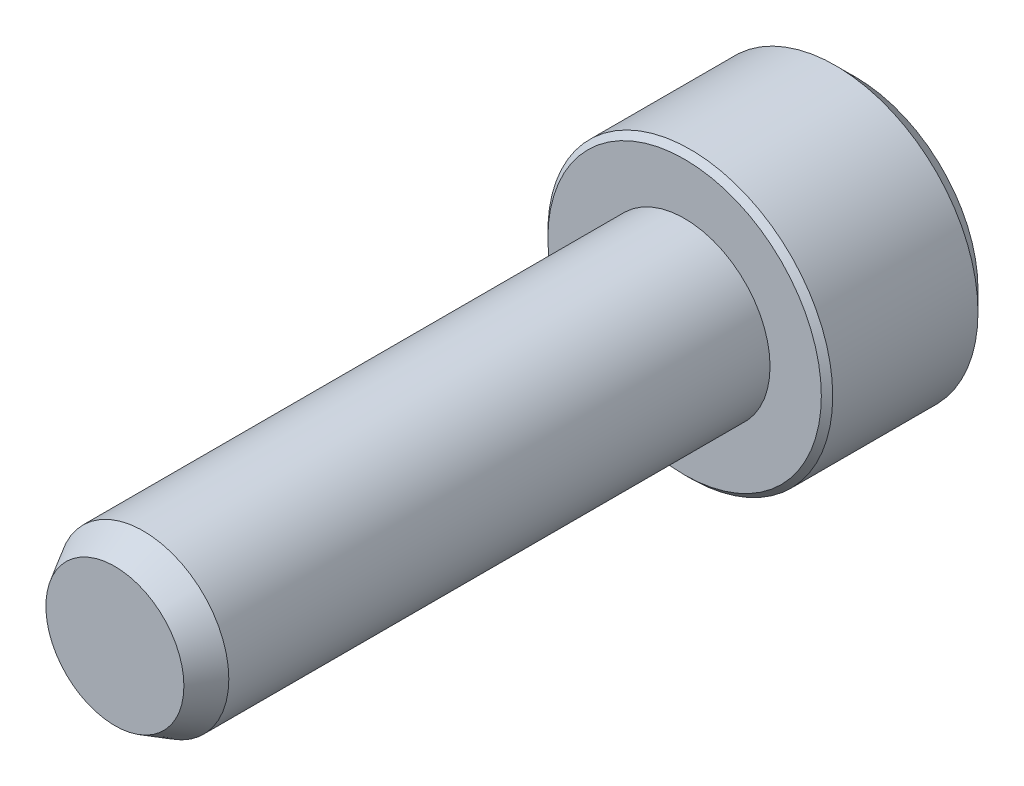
ISO-10303-21;
HEADER;
FILE_DESCRIPTION(('STEP AP214'),'2;1');
FILE_NAME('part.step','',(''),(''),'','','');
FILE_SCHEMA(('AUTOMOTIVE_DESIGN { 1 0 10303 214 1 1 1 1 }'));
ENDSEC;
DATA;
#1=APPLICATION_CONTEXT('core data for automotive mechanical design processes');
#2=APPLICATION_PROTOCOL_DEFINITION('international standard','automotive_design',2000,#1);
#3=PRODUCT_CONTEXT('',#1,'mechanical');
#4=PRODUCT('Part','Part','',(#3));
#5=PRODUCT_RELATED_PRODUCT_CATEGORY('part','',(#4));
#6=PRODUCT_DEFINITION_FORMATION('','',#4);
#7=PRODUCT_DEFINITION_CONTEXT('part definition',#1,'design');
#8=PRODUCT_DEFINITION('design','',#6,#7);
#9=PRODUCT_DEFINITION_SHAPE('','',#8);
#10=(LENGTH_UNIT() NAMED_UNIT(*) SI_UNIT(.MILLI.,.METRE.));
#11=(NAMED_UNIT(*) PLANE_ANGLE_UNIT() SI_UNIT($,.RADIAN.));
#12=(NAMED_UNIT(*) SI_UNIT($,.STERADIAN.) SOLID_ANGLE_UNIT());
#13=UNCERTAINTY_MEASURE_WITH_UNIT(LENGTH_MEASURE(1.E-05),#10,'distance_accuracy_value','');
#14=(GEOMETRIC_REPRESENTATION_CONTEXT(3) GLOBAL_UNCERTAINTY_ASSIGNED_CONTEXT((#13)) GLOBAL_UNIT_ASSIGNED_CONTEXT((#10,
#11,#12)) REPRESENTATION_CONTEXT('',''));
#15=CARTESIAN_POINT('',(0.,0.,0.));
#16=DIRECTION('',(0.,0.,1.));
#17=DIRECTION('',(1.,0.,0.));
#18=AXIS2_PLACEMENT_3D('',#15,#16,#17);
#19=CARTESIAN_POINT('',(0.,0.,-6.));
#20=DIRECTION('',(0.,0.,1.));
#21=DIRECTION('',(1.,0.,0.));
#22=AXIS2_PLACEMENT_3D('',#19,#20,#21);
#23=PLANE('',#22);
#24=CARTESIAN_POINT('',(0.,0.,-6.));
#25=DIRECTION('',(0.,0.,1.));
#26=DIRECTION('',(1.,0.,0.));
#27=AXIS2_PLACEMENT_3D('',#24,#25,#26);
#28=CIRCLE('',#27,4.3);
#29=CARTESIAN_POINT('',(4.3,0.,-6.));
#30=VERTEX_POINT('',#29);
#31=EDGE_CURVE('E140',#30,#30,#28,.F.);
#32=ORIENTED_EDGE('',*,*,#31,.T.);
#33=EDGE_LOOP('',(#32));
#34=FACE_BOUND('',#33,.T.);
#35=DIRECTION('',(-0.500000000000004,-0.866025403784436,0.));
#36=VECTOR('',#35,1.);
#37=CARTESIAN_POINT('',(-1.44337567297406,2.5,-6.));
#38=LINE('',#37,#36);
#39=CARTESIAN_POINT('',(-1.44337567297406,2.5,-6.));
#40=VERTEX_POINT('',#39);
#41=CARTESIAN_POINT('',(-2.88675134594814,0.,-6.));
#42=VERTEX_POINT('',#41);
#43=EDGE_CURVE('E47',#40,#42,#38,.T.);
#44=ORIENTED_EDGE('',*,*,#43,.T.);
#45=DIRECTION('',(0.500000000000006,-0.866025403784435,0.));
#46=VECTOR('',#45,1.);
#47=CARTESIAN_POINT('',(-2.88675134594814,0.,-6.));
#48=LINE('',#47,#46);
#49=CARTESIAN_POINT('',(-1.44337567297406,-2.5,-6.));
#50=VERTEX_POINT('',#49);
#51=EDGE_CURVE('E87',#42,#50,#48,.T.);
#52=ORIENTED_EDGE('',*,*,#51,.T.);
#53=DIRECTION('',(1.,0.,0.));
#54=VECTOR('',#53,1.);
#55=CARTESIAN_POINT('',(-1.44337567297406,-2.5,-6.));
#56=LINE('',#55,#54);
#57=CARTESIAN_POINT('',(1.44337567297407,-2.5,-6.));
#58=VERTEX_POINT('',#57);
#59=EDGE_CURVE('E95',#50,#58,#56,.T.);
#60=ORIENTED_EDGE('',*,*,#59,.T.);
#61=DIRECTION('',(0.500000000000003,0.866025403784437,0.));
#62=VECTOR('',#61,1.);
#63=CARTESIAN_POINT('',(1.44337567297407,-2.5,-6.));
#64=LINE('',#63,#62);
#65=CARTESIAN_POINT('',(2.88675134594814,0.,-6.));
#66=VERTEX_POINT('',#65);
#67=EDGE_CURVE('E110',#58,#66,#64,.T.);
#68=ORIENTED_EDGE('',*,*,#67,.T.);
#69=DIRECTION('',(-0.499999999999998,0.86602540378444,0.));
#70=VECTOR('',#69,1.);
#71=CARTESIAN_POINT('',(1.44337567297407,2.5,-6.));
#72=LINE('',#71,#70);
#73=CARTESIAN_POINT('',(1.44337567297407,2.5,-6.));
#74=VERTEX_POINT('',#73);
#75=EDGE_CURVE('E113',#66,#74,#72,.T.);
#76=ORIENTED_EDGE('',*,*,#75,.T.);
#77=DIRECTION('',(-1.,0.,0.));
#78=VECTOR('',#77,1.);
#79=CARTESIAN_POINT('',(-1.44337567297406,2.5,-6.));
#80=LINE('',#79,#78);
#81=EDGE_CURVE('E106',#74,#40,#80,.T.);
#82=ORIENTED_EDGE('',*,*,#81,.T.);
#83=EDGE_LOOP('',(#44,#52,#60,#68,#76,#82));
#84=FACE_BOUND('',#83,.T.);
#85=ADVANCED_FACE('F32',(#34,#84),#23,.F.);
#86=CARTESIAN_POINT('',(0.,0.,20.));
#87=DIRECTION('',(0.,0.,-1.));
#88=DIRECTION('',(-1.,0.,0.));
#89=AXIS2_PLACEMENT_3D('',#86,#87,#88);
#90=CYLINDRICAL_SURFACE('',#89,3.);
#91=CARTESIAN_POINT('',(0.,0.,19.));
#92=DIRECTION('',(0.,0.,1.));
#93=DIRECTION('',(1.,0.,0.));
#94=AXIS2_PLACEMENT_3D('',#91,#92,#93);
#95=CIRCLE('',#94,3.);
#96=CARTESIAN_POINT('',(3.,0.,19.));
#97=VERTEX_POINT('',#96);
#98=EDGE_CURVE('E146',#97,#97,#95,.F.);
#99=ORIENTED_EDGE('',*,*,#98,.T.);
#100=EDGE_LOOP('',(#99));
#101=FACE_BOUND('',#100,.T.);
#102=CARTESIAN_POINT('',(0.,0.,0.));
#103=DIRECTION('',(0.,0.,1.));
#104=DIRECTION('',(1.,0.,0.));
#105=AXIS2_PLACEMENT_3D('',#102,#103,#104);
#106=CIRCLE('',#105,3.);
#107=CARTESIAN_POINT('',(3.,0.,0.));
#108=VERTEX_POINT('',#107);
#109=EDGE_CURVE('E101',#108,#108,#106,.T.);
#110=ORIENTED_EDGE('',*,*,#109,.T.);
#111=EDGE_LOOP('',(#110));
#112=FACE_BOUND('',#111,.T.);
#113=ADVANCED_FACE('F34',(#101,#112),#90,.T.);
#114=CARTESIAN_POINT('',(0.,0.,20.));
#115=DIRECTION('',(0.,0.,1.));
#116=DIRECTION('',(1.,0.,0.));
#117=AXIS2_PLACEMENT_3D('',#114,#115,#116);
#118=PLANE('',#117);
#119=CARTESIAN_POINT('',(0.,0.,20.));
#120=DIRECTION('',(0.,0.,1.));
#121=DIRECTION('',(1.,0.,0.));
#122=AXIS2_PLACEMENT_3D('',#119,#120,#121);
#123=CIRCLE('',#122,2.42264973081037);
#124=CARTESIAN_POINT('',(2.42264973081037,0.,20.));
#125=VERTEX_POINT('',#124);
#126=EDGE_CURVE('E143',#125,#125,#123,.T.);
#127=ORIENTED_EDGE('',*,*,#126,.T.);
#128=EDGE_LOOP('',(#127));
#129=FACE_BOUND('',#128,.T.);
#130=ADVANCED_FACE('F172',(#129),#118,.T.);
#131=CARTESIAN_POINT('',(0.,0.,0.));
#132=DIRECTION('',(0.,0.,1.));
#133=DIRECTION('',(1.,0.,0.));
#134=AXIS2_PLACEMENT_3D('',#131,#132,#133);
#135=PLANE('',#134);
#136=CARTESIAN_POINT('',(0.,0.,0.));
#137=DIRECTION('',(0.,0.,1.));
#138=DIRECTION('',(1.,0.,0.));
#139=AXIS2_PLACEMENT_3D('',#136,#137,#138);
#140=CIRCLE('',#139,4.8);
#141=CARTESIAN_POINT('',(4.8,0.,0.));
#142=VERTEX_POINT('',#141);
#143=EDGE_CURVE('E40',#142,#142,#140,.T.);
#144=ORIENTED_EDGE('',*,*,#143,.T.);
#145=EDGE_LOOP('',(#144));
#146=FACE_BOUND('',#145,.T.);
#147=ORIENTED_EDGE('',*,*,#109,.F.);
#148=EDGE_LOOP('',(#147));
#149=FACE_BOUND('',#148,.T.);
#150=ADVANCED_FACE('F151',(#146,#149),#135,.T.);
#151=CARTESIAN_POINT('',(0.,0.,-6.));
#152=DIRECTION('',(0.,0.,1.));
#153=DIRECTION('',(1.,0.,0.));
#154=AXIS2_PLACEMENT_3D('',#151,#152,#153);
#155=CYLINDRICAL_SURFACE('',#154,5.);
#156=CARTESIAN_POINT('',(0.,0.,-0.200000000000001));
#157=DIRECTION('',(0.,0.,1.));
#158=DIRECTION('',(1.,0.,0.));
#159=AXIS2_PLACEMENT_3D('',#156,#157,#158);
#160=CIRCLE('',#159,5.);
#161=CARTESIAN_POINT('',(5.,0.,-0.200000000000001));
#162=VERTEX_POINT('',#161);
#163=EDGE_CURVE('E11',#162,#162,#160,.F.);
#164=ORIENTED_EDGE('',*,*,#163,.T.);
#165=EDGE_LOOP('',(#164));
#166=FACE_BOUND('',#165,.T.);
#167=CARTESIAN_POINT('',(0.,0.,-5.3));
#168=DIRECTION('',(0.,0.,1.));
#169=DIRECTION('',(1.,0.,0.));
#170=AXIS2_PLACEMENT_3D('',#167,#168,#169);
#171=CIRCLE('',#170,5.);
#172=CARTESIAN_POINT('',(5.,0.,-5.3));
#173=VERTEX_POINT('',#172);
#174=EDGE_CURVE('E137',#173,#173,#171,.T.);
#175=ORIENTED_EDGE('',*,*,#174,.T.);
#176=EDGE_LOOP('',(#175));
#177=FACE_BOUND('',#176,.T.);
#178=ADVANCED_FACE('F177',(#166,#177),#155,.T.);
#179=CARTESIAN_POINT('',(-1.44337567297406,2.5,-3.));
#180=DIRECTION('',(0.866025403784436,-0.500000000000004,0.));
#181=DIRECTION('',(0.500000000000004,0.866025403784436,0.));
#182=AXIS2_PLACEMENT_3D('',#179,#180,#181);
#183=PLANE('',#182);
#184=ORIENTED_EDGE('',*,*,#43,.F.);
#185=DIRECTION('',(0.,0.,-1.));
#186=VECTOR('',#185,1.);
#187=CARTESIAN_POINT('',(-1.44337567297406,2.5,-3.));
#188=LINE('',#187,#186);
#189=CARTESIAN_POINT('',(-1.44337567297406,2.5,-3.));
#190=VERTEX_POINT('',#189);
#191=EDGE_CURVE('E126',#190,#40,#188,.T.);
#192=ORIENTED_EDGE('',*,*,#191,.F.);
#193=DIRECTION('',(-0.500000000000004,-0.866025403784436,0.));
#194=VECTOR('',#193,1.);
#195=CARTESIAN_POINT('',(-1.44337567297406,2.5,-3.));
#196=LINE('',#195,#194);
#197=CARTESIAN_POINT('',(-2.88675134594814,0.,-3.));
#198=VERTEX_POINT('',#197);
#199=EDGE_CURVE('E100',#190,#198,#196,.T.);
#200=ORIENTED_EDGE('',*,*,#199,.T.);
#201=DIRECTION('',(0.,0.,-1.));
#202=VECTOR('',#201,1.);
#203=CARTESIAN_POINT('',(-2.88675134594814,0.,-3.));
#204=LINE('',#203,#202);
#205=EDGE_CURVE('E89',#198,#42,#204,.T.);
#206=ORIENTED_EDGE('',*,*,#205,.T.);
#207=EDGE_LOOP('',(#184,#192,#200,#206));
#208=FACE_BOUND('',#207,.T.);
#209=ADVANCED_FACE('F98',(#208),#183,.T.);
#210=CARTESIAN_POINT('',(-2.88675134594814,0.,-3.));
#211=DIRECTION('',(0.866025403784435,0.500000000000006,0.));
#212=DIRECTION('',(-0.500000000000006,0.866025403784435,0.));
#213=AXIS2_PLACEMENT_3D('',#210,#211,#212);
#214=PLANE('',#213);
#215=ORIENTED_EDGE('',*,*,#51,.F.);
#216=ORIENTED_EDGE('',*,*,#205,.F.);
#217=DIRECTION('',(0.500000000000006,-0.866025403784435,0.));
#218=VECTOR('',#217,1.);
#219=CARTESIAN_POINT('',(-2.88675134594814,0.,-3.));
#220=LINE('',#219,#218);
#221=CARTESIAN_POINT('',(-1.44337567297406,-2.5,-3.));
#222=VERTEX_POINT('',#221);
#223=EDGE_CURVE('E117',#198,#222,#220,.T.);
#224=ORIENTED_EDGE('',*,*,#223,.T.);
#225=DIRECTION('',(0.,0.,-1.));
#226=VECTOR('',#225,1.);
#227=CARTESIAN_POINT('',(-1.44337567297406,-2.5,-3.));
#228=LINE('',#227,#226);
#229=EDGE_CURVE('E91',#222,#50,#228,.T.);
#230=ORIENTED_EDGE('',*,*,#229,.T.);
#231=EDGE_LOOP('',(#215,#216,#224,#230));
#232=FACE_BOUND('',#231,.T.);
#233=ADVANCED_FACE('F88',(#232),#214,.T.);
#234=CARTESIAN_POINT('',(-1.44337567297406,-2.5,-3.));
#235=DIRECTION('',(0.,1.,0.));
#236=DIRECTION('',(0.,0.,1.));
#237=AXIS2_PLACEMENT_3D('',#234,#235,#236);
#238=PLANE('',#237);
#239=ORIENTED_EDGE('',*,*,#59,.F.);
#240=ORIENTED_EDGE('',*,*,#229,.F.);
#241=DIRECTION('',(1.,0.,0.));
#242=VECTOR('',#241,1.);
#243=CARTESIAN_POINT('',(-1.44337567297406,-2.5,-3.));
#244=LINE('',#243,#242);
#245=CARTESIAN_POINT('',(1.44337567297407,-2.5,-3.));
#246=VERTEX_POINT('',#245);
#247=EDGE_CURVE('E119',#222,#246,#244,.T.);
#248=ORIENTED_EDGE('',*,*,#247,.T.);
#249=DIRECTION('',(0.,0.,-1.));
#250=VECTOR('',#249,1.);
#251=CARTESIAN_POINT('',(1.44337567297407,-2.5,-3.));
#252=LINE('',#251,#250);
#253=EDGE_CURVE('E132',#246,#58,#252,.T.);
#254=ORIENTED_EDGE('',*,*,#253,.T.);
#255=EDGE_LOOP('',(#239,#240,#248,#254));
#256=FACE_BOUND('',#255,.T.);
#257=ADVANCED_FACE('F205',(#256),#238,.T.);
#258=CARTESIAN_POINT('',(1.44337567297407,-2.5,-3.));
#259=DIRECTION('',(-0.866025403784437,0.500000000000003,0.));
#260=DIRECTION('',(-0.500000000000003,-0.866025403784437,0.));
#261=AXIS2_PLACEMENT_3D('',#258,#259,#260);
#262=PLANE('',#261);
#263=ORIENTED_EDGE('',*,*,#67,.F.);
#264=ORIENTED_EDGE('',*,*,#253,.F.);
#265=DIRECTION('',(0.500000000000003,0.866025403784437,0.));
#266=VECTOR('',#265,1.);
#267=CARTESIAN_POINT('',(1.44337567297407,-2.5,-3.));
#268=LINE('',#267,#266);
#269=CARTESIAN_POINT('',(2.88675134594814,0.,-3.));
#270=VERTEX_POINT('',#269);
#271=EDGE_CURVE('E121',#246,#270,#268,.T.);
#272=ORIENTED_EDGE('',*,*,#271,.T.);
#273=DIRECTION('',(0.,0.,-1.));
#274=VECTOR('',#273,1.);
#275=CARTESIAN_POINT('',(2.88675134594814,0.,-3.));
#276=LINE('',#275,#274);
#277=EDGE_CURVE('E130',#270,#66,#276,.T.);
#278=ORIENTED_EDGE('',*,*,#277,.T.);
#279=EDGE_LOOP('',(#263,#264,#272,#278));
#280=FACE_BOUND('',#279,.T.);
#281=ADVANCED_FACE('F212',(#280),#262,.T.);
#282=CARTESIAN_POINT('',(1.44337567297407,2.5,-3.));
#283=DIRECTION('',(-0.86602540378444,-0.499999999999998,0.));
#284=DIRECTION('',(0.499999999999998,-0.86602540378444,0.));
#285=AXIS2_PLACEMENT_3D('',#282,#283,#284);
#286=PLANE('',#285);
#287=ORIENTED_EDGE('',*,*,#75,.F.);
#288=ORIENTED_EDGE('',*,*,#277,.F.);
#289=DIRECTION('',(-0.499999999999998,0.86602540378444,0.));
#290=VECTOR('',#289,1.);
#291=CARTESIAN_POINT('',(1.44337567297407,2.5,-3.));
#292=LINE('',#291,#290);
#293=CARTESIAN_POINT('',(1.44337567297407,2.5,-3.));
#294=VERTEX_POINT('',#293);
#295=EDGE_CURVE('E123',#270,#294,#292,.T.);
#296=ORIENTED_EDGE('',*,*,#295,.T.);
#297=DIRECTION('',(0.,0.,-1.));
#298=VECTOR('',#297,1.);
#299=CARTESIAN_POINT('',(1.44337567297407,2.5,-3.));
#300=LINE('',#299,#298);
#301=EDGE_CURVE('E128',#294,#74,#300,.T.);
#302=ORIENTED_EDGE('',*,*,#301,.T.);
#303=EDGE_LOOP('',(#287,#288,#296,#302));
#304=FACE_BOUND('',#303,.T.);
#305=ADVANCED_FACE('F220',(#304),#286,.T.);
#306=CARTESIAN_POINT('',(-1.44337567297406,2.5,-3.));
#307=DIRECTION('',(0.,-1.,0.));
#308=DIRECTION('',(0.,0.,-1.));
#309=AXIS2_PLACEMENT_3D('',#306,#307,#308);
#310=PLANE('',#309);
#311=ORIENTED_EDGE('',*,*,#81,.F.);
#312=ORIENTED_EDGE('',*,*,#301,.F.);
#313=DIRECTION('',(-1.,0.,0.));
#314=VECTOR('',#313,1.);
#315=CARTESIAN_POINT('',(-1.44337567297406,2.5,-3.));
#316=LINE('',#315,#314);
#317=EDGE_CURVE('E54',#294,#190,#316,.T.);
#318=ORIENTED_EDGE('',*,*,#317,.T.);
#319=ORIENTED_EDGE('',*,*,#191,.T.);
#320=EDGE_LOOP('',(#311,#312,#318,#319));
#321=FACE_BOUND('',#320,.T.);
#322=ADVANCED_FACE('F228',(#321),#310,.T.);
#323=CARTESIAN_POINT('',(-2.88675134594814,0.,-3.));
#324=DIRECTION('',(0.,0.,1.));
#325=DIRECTION('',(1.,0.,0.));
#326=AXIS2_PLACEMENT_3D('',#323,#324,#325);
#327=PLANE('',#326);
#328=ORIENTED_EDGE('',*,*,#199,.F.);
#329=ORIENTED_EDGE('',*,*,#317,.F.);
#330=ORIENTED_EDGE('',*,*,#295,.F.);
#331=ORIENTED_EDGE('',*,*,#271,.F.);
#332=ORIENTED_EDGE('',*,*,#247,.F.);
#333=ORIENTED_EDGE('',*,*,#223,.F.);
#334=EDGE_LOOP('',(#328,#329,#330,#331,#332,#333));
#335=FACE_BOUND('',#334,.T.);
#336=ADVANCED_FACE('F236',(#335),#327,.F.);
#337=CARTESIAN_POINT('',(0.,0.,-5.3));
#338=DIRECTION('',(0.,0.,1.));
#339=DIRECTION('',(1.,0.,0.));
#340=AXIS2_PLACEMENT_3D('',#337,#338,#339);
#341=CONICAL_SURFACE('',#340,5.,0.78539816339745);
#342=ORIENTED_EDGE('',*,*,#31,.F.);
#343=EDGE_LOOP('',(#342));
#344=FACE_BOUND('',#343,.T.);
#345=ORIENTED_EDGE('',*,*,#174,.F.);
#346=EDGE_LOOP('',(#345));
#347=FACE_BOUND('',#346,.T.);
#348=ADVANCED_FACE('F162',(#344,#347),#341,.T.);
#349=CARTESIAN_POINT('',(0.,0.,20.));
#350=DIRECTION('',(0.,0.,-1.));
#351=DIRECTION('',(-1.,0.,0.));
#352=AXIS2_PLACEMENT_3D('',#349,#350,#351);
#353=CONICAL_SURFACE('',#352,2.42264973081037,0.523598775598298);
#354=ORIENTED_EDGE('',*,*,#98,.F.);
#355=EDGE_LOOP('',(#354));
#356=FACE_BOUND('',#355,.T.);
#357=ORIENTED_EDGE('',*,*,#126,.F.);
#358=EDGE_LOOP('',(#357));
#359=FACE_BOUND('',#358,.T.);
#360=ADVANCED_FACE('F156',(#356,#359),#353,.T.);
#361=CARTESIAN_POINT('',(0.,0.,0.));
#362=DIRECTION('',(0.,0.,-1.));
#363=DIRECTION('',(-1.,0.,0.));
#364=AXIS2_PLACEMENT_3D('',#361,#362,#363);
#365=CONICAL_SURFACE('',#364,4.8,0.785398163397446);
#366=ORIENTED_EDGE('',*,*,#163,.F.);
#367=EDGE_LOOP('',(#366));
#368=FACE_BOUND('',#367,.T.);
#369=ORIENTED_EDGE('',*,*,#143,.F.);
#370=EDGE_LOOP('',(#369));
#371=FACE_BOUND('',#370,.T.);
#372=ADVANCED_FACE('F154',(#368,#371),#365,.T.);
#373=CLOSED_SHELL('',(#85,#113,#130,#150,#178,#209,#233,#257,#281,#305,#322,#336,#348,#360,#372));
#374=MANIFOLD_SOLID_BREP('B2',#373);
#375=ADVANCED_BREP_SHAPE_REPRESENTATION('',(#18,#374),#14);
#376=SHAPE_DEFINITION_REPRESENTATION(#9,#375);
ENDSEC;
END-ISO-10303-21;
